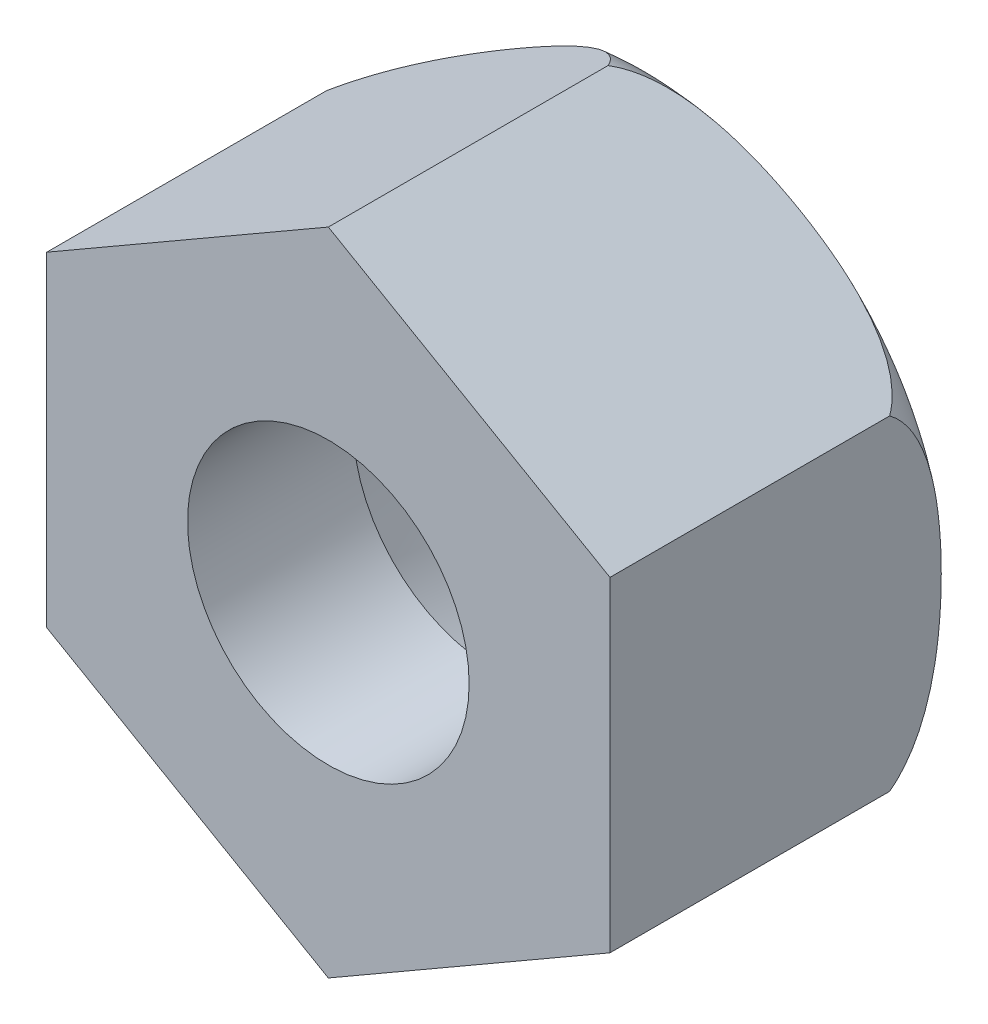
ISO-10303-21;
HEADER;
FILE_DESCRIPTION(('STEP AP214'),'2;1');
FILE_NAME('part.step','',(''),(''),'','','');
FILE_SCHEMA(('AUTOMOTIVE_DESIGN { 1 0 10303 214 1 1 1 1 }'));
ENDSEC;
DATA;
#1=APPLICATION_CONTEXT('core data for automotive mechanical design processes');
#2=APPLICATION_PROTOCOL_DEFINITION('international standard','automotive_design',2000,#1);
#3=PRODUCT_CONTEXT('',#1,'mechanical');
#4=PRODUCT('Part','Part','',(#3));
#5=PRODUCT_RELATED_PRODUCT_CATEGORY('part','',(#4));
#6=PRODUCT_DEFINITION_FORMATION('','',#4);
#7=PRODUCT_DEFINITION_CONTEXT('part definition',#1,'design');
#8=PRODUCT_DEFINITION('design','',#6,#7);
#9=PRODUCT_DEFINITION_SHAPE('','',#8);
#10=(LENGTH_UNIT() NAMED_UNIT(*) SI_UNIT(.MILLI.,.METRE.));
#11=(NAMED_UNIT(*) PLANE_ANGLE_UNIT() SI_UNIT($,.RADIAN.));
#12=(NAMED_UNIT(*) SI_UNIT($,.STERADIAN.) SOLID_ANGLE_UNIT());
#13=UNCERTAINTY_MEASURE_WITH_UNIT(LENGTH_MEASURE(1.E-05),#10,'distance_accuracy_value','');
#14=(GEOMETRIC_REPRESENTATION_CONTEXT(3) GLOBAL_UNCERTAINTY_ASSIGNED_CONTEXT((#13)) GLOBAL_UNIT_ASSIGNED_CONTEXT((#10,
#11,#12)) REPRESENTATION_CONTEXT('',''));
#15=CARTESIAN_POINT('',(0.,0.,0.));
#16=DIRECTION('',(0.,0.,1.));
#17=DIRECTION('',(1.,0.,0.));
#18=AXIS2_PLACEMENT_3D('',#15,#16,#17);
#19=CARTESIAN_POINT('',(0.,9.81495457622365,0.));
#20=DIRECTION('',(0.,0.,1.));
#21=DIRECTION('',(1.,0.,0.));
#22=AXIS2_PLACEMENT_3D('',#19,#20,#21);
#23=PLANE('',#22);
#24=CARTESIAN_POINT('',(0.,0.,0.));
#25=DIRECTION('',(0.,0.,1.));
#26=DIRECTION('',(1.,0.,0.));
#27=AXIS2_PLACEMENT_3D('',#24,#25,#26);
#28=CIRCLE('',#27,5.9);
#29=CARTESIAN_POINT('',(5.90000000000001,0.,0.));
#30=VERTEX_POINT('',#29);
#31=EDGE_CURVE('E235',#30,#30,#28,.T.);
#32=ORIENTED_EDGE('',*,*,#31,.T.);
#33=EDGE_LOOP('',(#32));
#34=FACE_BOUND('',#33,.T.);
#35=CARTESIAN_POINT('',(0.,0.,0.));
#36=DIRECTION('',(0.,0.,1.));
#37=DIRECTION('',(1.,0.,0.));
#38=AXIS2_PLACEMENT_3D('',#35,#36,#37);
#39=CIRCLE('',#38,8.50000000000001);
#40=CARTESIAN_POINT('',(8.49999999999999,0.,0.));
#41=VERTEX_POINT('',#40);
#42=CARTESIAN_POINT('',(4.25,7.36121593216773,0.));
#43=VERTEX_POINT('',#42);
#44=EDGE_CURVE('E56',#41,#43,#39,.T.);
#45=ORIENTED_EDGE('',*,*,#44,.F.);
#46=CARTESIAN_POINT('',(4.25,-7.36121593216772,0.));
#47=VERTEX_POINT('',#46);
#48=EDGE_CURVE('E112',#47,#41,#39,.T.);
#49=ORIENTED_EDGE('',*,*,#48,.F.);
#50=CARTESIAN_POINT('',(-4.25000000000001,-7.36121593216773,0.));
#51=VERTEX_POINT('',#50);
#52=EDGE_CURVE('E119',#51,#47,#39,.T.);
#53=ORIENTED_EDGE('',*,*,#52,.F.);
#54=CARTESIAN_POINT('',(-8.50000000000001,0.,0.));
#55=VERTEX_POINT('',#54);
#56=EDGE_CURVE('E292',#55,#51,#39,.T.);
#57=ORIENTED_EDGE('',*,*,#56,.F.);
#58=CARTESIAN_POINT('',(-4.25,7.36121593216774,0.));
#59=VERTEX_POINT('',#58);
#60=EDGE_CURVE('E138',#59,#55,#39,.T.);
#61=ORIENTED_EDGE('',*,*,#60,.F.);
#62=EDGE_CURVE('E136',#43,#59,#39,.T.);
#63=ORIENTED_EDGE('',*,*,#62,.F.);
#64=EDGE_LOOP('',(#45,#49,#53,#57,#61,#63));
#65=FACE_BOUND('',#64,.T.);
#66=ADVANCED_FACE('F36',(#34,#65),#23,.F.);
#67=CARTESIAN_POINT('',(8.49999999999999,4.90747728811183,10.));
#68=DIRECTION('',(-0.5,-0.866025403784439,0.));
#69=DIRECTION('',(0.866025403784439,-0.5,0.));
#70=AXIS2_PLACEMENT_3D('',#67,#68,#69);
#71=PLANE('',#70);
#72=CARTESIAN_POINT('',(-0.000199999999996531,9.81507004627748,1.55758712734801));
#73=CARTESIAN_POINT('',(0.0451150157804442,9.78890740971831,1.48692454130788));
#74=CARTESIAN_POINT('',(0.0940565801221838,9.76065098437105,1.41958595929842));
#75=CARTESIAN_POINT('',(0.197763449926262,9.70077579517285,1.29156124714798));
#76=CARTESIAN_POINT('',(0.252509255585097,9.66916828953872,1.23085415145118));
#77=CARTESIAN_POINT('',(0.4218034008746,9.5714262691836,1.06005183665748));
#78=CARTESIAN_POINT('',(0.543083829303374,9.50140498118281,0.958824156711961));
#79=CARTESIAN_POINT('',(0.762929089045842,9.37447726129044,0.801627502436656));
#80=CARTESIAN_POINT('',(0.859001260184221,9.31900996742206,0.740772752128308));
#81=CARTESIAN_POINT('',(1.05542378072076,9.20560537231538,0.629010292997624));
#82=CARTESIAN_POINT('',(1.15577537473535,9.14766735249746,0.578105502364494));
#83=CARTESIAN_POINT('',(1.36036017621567,9.02955026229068,0.484564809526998));
#84=CARTESIAN_POINT('',(1.46462080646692,8.96935535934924,0.442010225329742));
#85=CARTESIAN_POINT('',(1.67521990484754,8.8477659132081,0.364558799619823));
#86=CARTESIAN_POINT('',(1.78155816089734,8.78637149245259,0.329661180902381));
#87=CARTESIAN_POINT('',(2.00165570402,8.65929811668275,0.264714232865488));
#88=CARTESIAN_POINT('',(2.11549798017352,8.59357124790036,0.235044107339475));
#89=CARTESIAN_POINT('',(2.34429600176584,8.46147464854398,0.182028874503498));
#90=CARTESIAN_POINT('',(2.4592520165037,8.39510476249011,0.158685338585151));
#91=CARTESIAN_POINT('',(2.68999824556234,8.26188336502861,0.117459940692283));
#92=CARTESIAN_POINT('',(2.80578914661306,8.19503145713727,0.0995832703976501));
#93=CARTESIAN_POINT('',(3.03786108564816,8.06104466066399,0.0686375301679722));
#94=CARTESIAN_POINT('',(3.15414218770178,7.99390973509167,0.0555691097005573));
#95=CARTESIAN_POINT('',(3.38705597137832,7.85943689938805,0.0337218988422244));
#96=CARTESIAN_POINT('',(3.50368879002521,7.79209891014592,0.0249450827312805));
#97=CARTESIAN_POINT('',(3.73711532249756,7.65733003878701,0.0113338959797));
#98=CARTESIAN_POINT('',(3.8539090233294,7.58989916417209,0.0064992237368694));
#99=CARTESIAN_POINT('',(4.08749751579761,7.45503678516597,0.000571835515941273));
#100=CARTESIAN_POINT('',(4.20429226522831,7.38760530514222,-0.000523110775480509));
#101=CARTESIAN_POINT('',(4.43785808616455,7.25275601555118,0.000980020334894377));
#102=CARTESIAN_POINT('',(4.55462915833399,7.1853382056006,0.00357797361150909));
#103=CARTESIAN_POINT('',(4.84435832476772,7.018062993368,0.0147301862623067));
#104=CARTESIAN_POINT('',(5.01725659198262,6.91824013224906,0.0255526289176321));
#105=CARTESIAN_POINT('',(5.36248853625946,6.71892037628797,0.0564890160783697));
#106=CARTESIAN_POINT('',(5.53482205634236,6.61942357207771,0.0766053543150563));
#107=CARTESIAN_POINT('',(5.87770250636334,6.42146145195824,0.127795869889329));
#108=CARTESIAN_POINT('',(6.04825352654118,6.32299377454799,0.158832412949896));
#109=CARTESIAN_POINT('',(6.3870494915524,6.1273898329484,0.234391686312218));
#110=CARTESIAN_POINT('',(6.55529588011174,6.03025273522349,0.278905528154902));
#111=CARTESIAN_POINT('',(6.89522854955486,5.83399251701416,0.387164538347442));
#112=CARTESIAN_POINT('',(7.06673713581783,5.7349719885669,0.451674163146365));
#113=CARTESIAN_POINT('',(7.40220072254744,5.54129199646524,0.604191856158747));
#114=CARTESIAN_POINT('',(7.56615150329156,5.44663496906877,0.692212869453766));
#115=CARTESIAN_POINT('',(7.84351273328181,5.28650038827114,0.873768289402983));
#116=CARTESIAN_POINT('',(7.95983414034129,5.21934219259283,0.961304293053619));
#117=CARTESIAN_POINT('',(8.17899067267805,5.09281210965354,1.15619183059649));
#118=CARTESIAN_POINT('',(8.28188746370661,5.03340461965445,1.26344688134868));
#119=CARTESIAN_POINT('',(8.41892793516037,4.95428426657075,1.4375927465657));
#120=CARTESIAN_POINT('',(8.46093840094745,4.9300295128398,1.49635692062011));
#121=CARTESIAN_POINT('',(8.50019999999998,4.907361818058,1.55758712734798));
#122=B_SPLINE_CURVE_WITH_KNOTS('',3,(#72,#73,#74,#75,#76,#77,#78,#79,#80,#81,#82,#83,#84,#85,
#86,#87,#88,#89,#90,#91,#92,#93,#94,#95,#96,#97,#98,#99,#100,#101,#102,#103,#104,#105,#106,#107,
#108,#109,#110,#111,#112,#113,#114,#115,#116,#117,#118,#119,#120,#121),.UNSPECIFIED.,.F.,.F.,(4,
2,2,2,2,2,2,2,2,2,2,2,2,2,2,2,2,2,2,2,2,2,2,2,4),(0.,0.263341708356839,0.525825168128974,
1.04158623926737,1.42072803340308,1.79998085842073,2.18276133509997,2.56550294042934,
2.96960199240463,3.37380132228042,3.77838332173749,4.18301994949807,4.58784254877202,
4.99263417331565,5.39718434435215,5.80172091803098,6.40133913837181,7.00111188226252,
7.59883755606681,8.19616987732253,8.81995881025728,9.44409190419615,9.92367333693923,
10.400967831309,10.6293047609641),.UNSPECIFIED.);
#123=CARTESIAN_POINT('',(9.3240418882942E-12,9.81495457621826,1.55727523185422));
#124=VERTEX_POINT('',#123);
#125=EDGE_CURVE('E274',#124,#43,#122,.T.);
#126=ORIENTED_EDGE('',*,*,#125,.F.);
#127=DIRECTION('',(0.,0.,-1.));
#128=VECTOR('',#127,1.);
#129=CARTESIAN_POINT('',(0.,9.81495457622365,10.));
#130=LINE('',#129,#128);
#131=CARTESIAN_POINT('',(0.,9.81495457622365,10.));
#132=VERTEX_POINT('',#131);
#133=EDGE_CURVE('E128',#132,#124,#130,.T.);
#134=ORIENTED_EDGE('',*,*,#133,.F.);
#135=DIRECTION('',(-0.866025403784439,0.5,0.));
#136=VECTOR('',#135,1.);
#137=CARTESIAN_POINT('',(8.49999999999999,4.90747728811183,10.));
#138=LINE('',#137,#136);
#139=CARTESIAN_POINT('',(8.49999999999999,4.90747728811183,10.));
#140=VERTEX_POINT('',#139);
#141=EDGE_CURVE('E243',#140,#132,#138,.T.);
#142=ORIENTED_EDGE('',*,*,#141,.F.);
#143=DIRECTION('',(0.,0.,-1.));
#144=VECTOR('',#143,1.);
#145=CARTESIAN_POINT('',(8.49999999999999,4.90747728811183,10.));
#146=LINE('',#145,#144);
#147=CARTESIAN_POINT('',(8.49999999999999,4.90747728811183,1.55727523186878));
#148=VERTEX_POINT('',#147);
#149=EDGE_CURVE('E256',#140,#148,#146,.T.);
#150=ORIENTED_EDGE('',*,*,#149,.T.);
#151=EDGE_CURVE('E124',#43,#148,#122,.T.);
#152=ORIENTED_EDGE('',*,*,#151,.F.);
#153=EDGE_LOOP('',(#126,#134,#142,#150,#152));
#154=FACE_BOUND('',#153,.T.);
#155=ADVANCED_FACE('F38',(#154),#71,.F.);
#156=CARTESIAN_POINT('',(0.,9.81495457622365,10.));
#157=DIRECTION('',(0.5,-0.866025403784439,0.));
#158=DIRECTION('',(0.866025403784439,0.5,0.));
#159=AXIS2_PLACEMENT_3D('',#156,#157,#158);
#160=PLANE('',#159);
#161=CARTESIAN_POINT('',(-8.50019999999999,4.90736181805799,1.55758712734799));
#162=CARTESIAN_POINT('',(-8.45488498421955,4.93352445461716,1.48692454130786));
#163=CARTESIAN_POINT('',(-8.40594341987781,4.96178087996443,1.4195859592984));
#164=CARTESIAN_POINT('',(-8.30223655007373,5.02165606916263,1.29156124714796));
#165=CARTESIAN_POINT('',(-8.24749074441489,5.05326357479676,1.23085415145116));
#166=CARTESIAN_POINT('',(-8.07819659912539,5.15100559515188,1.06005183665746));
#167=CARTESIAN_POINT('',(-7.95691617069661,5.22102688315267,0.95882415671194));
#168=CARTESIAN_POINT('',(-7.73707091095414,5.34795460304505,0.801627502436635));
#169=CARTESIAN_POINT('',(-7.64099873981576,5.40342189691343,0.740772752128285));
#170=CARTESIAN_POINT('',(-7.44457621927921,5.5168264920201,0.629010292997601));
#171=CARTESIAN_POINT('',(-7.34422462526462,5.57476451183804,0.578105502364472));
#172=CARTESIAN_POINT('',(-7.13963982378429,5.69288160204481,0.484564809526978));
#173=CARTESIAN_POINT('',(-7.03537919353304,5.75307650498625,0.442010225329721));
#174=CARTESIAN_POINT('',(-6.82478009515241,5.8746659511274,0.364558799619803));
#175=CARTESIAN_POINT('',(-6.71844183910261,5.93606037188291,0.329661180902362));
#176=CARTESIAN_POINT('',(-6.49834429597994,6.06313374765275,0.26471423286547));
#177=CARTESIAN_POINT('',(-6.38450201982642,6.12886061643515,0.235044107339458));
#178=CARTESIAN_POINT('',(-6.1557039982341,6.26095721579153,0.182028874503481));
#179=CARTESIAN_POINT('',(-6.04074798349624,6.3273271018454,0.158685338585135));
#180=CARTESIAN_POINT('',(-5.81000175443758,6.46054849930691,0.117459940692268));
#181=CARTESIAN_POINT('',(-5.69421085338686,6.52740040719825,0.0995832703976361));
#182=CARTESIAN_POINT('',(-5.46213891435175,6.66138720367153,0.0686375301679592));
#183=CARTESIAN_POINT('',(-5.34585781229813,6.72852212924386,0.0555691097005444));
#184=CARTESIAN_POINT('',(-5.11294402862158,6.86299496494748,0.0337218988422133));
#185=CARTESIAN_POINT('',(-4.99631120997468,6.93033295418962,0.0249450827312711));
#186=CARTESIAN_POINT('',(-4.76288467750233,7.06510182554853,0.0113338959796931));
#187=CARTESIAN_POINT('',(-4.64609097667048,7.13253270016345,0.0064992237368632));
#188=CARTESIAN_POINT('',(-4.41250248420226,7.26739507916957,0.000571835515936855));
#189=CARTESIAN_POINT('',(-4.29570773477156,7.33482655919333,-0.000523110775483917));
#190=CARTESIAN_POINT('',(-4.06214191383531,7.46967584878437,0.000980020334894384));
#191=CARTESIAN_POINT('',(-3.94537084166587,7.53709365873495,0.00357797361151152));
#192=CARTESIAN_POINT('',(-3.65564167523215,7.70436887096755,0.0147301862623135));
#193=CARTESIAN_POINT('',(-3.48274340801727,7.80419173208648,0.0255526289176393));
#194=CARTESIAN_POINT('',(-3.13751146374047,8.00351148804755,0.0564890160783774));
#195=CARTESIAN_POINT('',(-2.96517794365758,8.1030082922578,0.0766053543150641));
#196=CARTESIAN_POINT('',(-2.62229749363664,8.30097041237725,0.127795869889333));
#197=CARTESIAN_POINT('',(-2.45174647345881,8.39943808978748,0.158832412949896));
#198=CARTESIAN_POINT('',(-2.11295050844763,8.59504203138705,0.234391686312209));
#199=CARTESIAN_POINT('',(-1.94470411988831,8.69217912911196,0.27890552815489));
#200=CARTESIAN_POINT('',(-1.60477145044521,8.88843934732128,0.387164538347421));
#201=CARTESIAN_POINT('',(-1.43326286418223,8.98745987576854,0.45167416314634));
#202=CARTESIAN_POINT('',(-1.09779927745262,9.1811398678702,0.604191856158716));
#203=CARTESIAN_POINT('',(-0.933848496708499,9.27579689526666,0.692212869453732));
#204=CARTESIAN_POINT('',(-0.656487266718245,9.4359314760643,0.873768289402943));
#205=CARTESIAN_POINT('',(-0.540165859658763,9.50308967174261,0.961304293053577));
#206=CARTESIAN_POINT('',(-0.321009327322,9.62961975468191,1.15619183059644));
#207=CARTESIAN_POINT('',(-0.218112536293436,9.68902724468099,1.26344688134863));
#208=CARTESIAN_POINT('',(-0.0810720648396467,9.76814759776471,1.43759274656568));
#209=CARTESIAN_POINT('',(-0.0390615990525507,9.79240235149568,1.49635692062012));
#210=CARTESIAN_POINT('',(0.000200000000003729,9.81507004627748,1.55758712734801));
#211=B_SPLINE_CURVE_WITH_KNOTS('',3,(#161,#162,#163,#164,#165,#166,#167,#168,#169,#170,#171,
#172,#173,#174,#175,#176,#177,#178,#179,#180,#181,#182,#183,#184,#185,#186,#187,#188,#189,#190,
#191,#192,#193,#194,#195,#196,#197,#198,#199,#200,#201,#202,#203,#204,#205,#206,#207,#208,#209,
#210),.UNSPECIFIED.,.F.,.F.,(4,2,2,2,2,2,2,2,2,2,2,2,2,2,2,2,2,2,2,2,2,2,2,2,4),(0.,
0.263341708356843,0.525825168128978,1.04158623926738,1.4207280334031,1.79998085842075,
2.1827613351,2.56550294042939,2.96960199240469,3.37380132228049,3.77838332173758,
4.18301994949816,4.58784254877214,4.99263417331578,5.39718434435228,5.80172091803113,
6.40133913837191,7.00111188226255,7.59883755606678,8.19616987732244,8.81995881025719,
9.44409190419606,9.92367333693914,10.4009678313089,10.6293047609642),.UNSPECIFIED.);
#212=CARTESIAN_POINT('',(-8.50000000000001,4.90747728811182,1.55727523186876));
#213=VERTEX_POINT('',#212);
#214=EDGE_CURVE('E175',#213,#59,#211,.T.);
#215=ORIENTED_EDGE('',*,*,#214,.F.);
#216=DIRECTION('',(0.,0.,-1.));
#217=VECTOR('',#216,1.);
#218=CARTESIAN_POINT('',(-8.50000000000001,4.90747728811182,10.));
#219=LINE('',#218,#217);
#220=CARTESIAN_POINT('',(-8.50000000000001,4.90747728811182,10.));
#221=VERTEX_POINT('',#220);
#222=EDGE_CURVE('E264',#221,#213,#219,.T.);
#223=ORIENTED_EDGE('',*,*,#222,.F.);
#224=DIRECTION('',(-0.866025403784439,-0.5,0.));
#225=VECTOR('',#224,1.);
#226=CARTESIAN_POINT('',(0.,9.81495457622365,10.));
#227=LINE('',#226,#225);
#228=EDGE_CURVE('E246',#132,#221,#227,.T.);
#229=ORIENTED_EDGE('',*,*,#228,.F.);
#230=ORIENTED_EDGE('',*,*,#133,.T.);
#231=EDGE_CURVE('E171',#59,#124,#211,.T.);
#232=ORIENTED_EDGE('',*,*,#231,.F.);
#233=EDGE_LOOP('',(#215,#223,#229,#230,#232));
#234=FACE_BOUND('',#233,.T.);
#235=ADVANCED_FACE('F181',(#234),#160,.F.);
#236=CARTESIAN_POINT('',(-8.50000000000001,4.90747728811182,10.));
#237=DIRECTION('',(1.,0.,0.));
#238=DIRECTION('',(0.,1.,0.));
#239=AXIS2_PLACEMENT_3D('',#236,#237,#238);
#240=PLANE('',#239);
#241=CARTESIAN_POINT('',(-8.50000000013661,0.,-7.89255239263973E-11));
#242=CARTESIAN_POINT('',(-8.50000000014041,0.253208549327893,-2.06588581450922E-06));
#243=CARTESIAN_POINT('',(-8.5000000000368,0.506417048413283,0.00644525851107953));
#244=CARTESIAN_POINT('',(-8.49999999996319,1.01232295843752,0.0331797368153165));
#245=CARTESIAN_POINT('',(-8.49999999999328,1.26501995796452,0.0534754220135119));
#246=CARTESIAN_POINT('',(-8.50000000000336,1.64216318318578,0.0964693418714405));
#247=CARTESIAN_POINT('',(-8.5000000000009,1.76733800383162,0.112851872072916));
#248=CARTESIAN_POINT('',(-8.49999999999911,2.01696843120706,0.150361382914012));
#249=CARTESIAN_POINT('',(-8.49999999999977,2.14142413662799,0.171487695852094));
#250=CARTESIAN_POINT('',(-8.50000000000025,2.38914915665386,0.219130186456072));
#251=CARTESIAN_POINT('',(-8.50000000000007,2.51241975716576,0.245639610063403));
#252=CARTESIAN_POINT('',(-8.49999999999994,2.75748485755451,0.304887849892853));
#253=CARTESIAN_POINT('',(-8.49999999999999,2.87927923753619,0.337627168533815));
#254=CARTESIAN_POINT('',(-8.50000000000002,3.11102646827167,0.407380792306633));
#255=CARTESIAN_POINT('',(-8.50000000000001,3.2211448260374,0.443840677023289));
#256=CARTESIAN_POINT('',(-8.5,3.43881150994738,0.52369435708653));
#257=CARTESIAN_POINT('',(-8.5,3.54636090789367,0.567085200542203));
#258=CARTESIAN_POINT('',(-8.50000000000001,3.75770908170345,0.66166669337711));
#259=CARTESIAN_POINT('',(-8.50000000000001,3.86151610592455,0.712838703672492));
#260=CARTESIAN_POINT('',(-8.50000000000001,4.06421706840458,0.824049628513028));
#261=CARTESIAN_POINT('',(-8.50000000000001,4.16311450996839,0.884082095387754));
#262=CARTESIAN_POINT('',(-8.50000000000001,4.36676792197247,1.02261218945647));
#263=CARTESIAN_POINT('',(-8.50000000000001,4.47059592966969,1.10249829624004));
#264=CARTESIAN_POINT('',(-8.50000000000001,4.6659395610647,1.27624818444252));
#265=CARTESIAN_POINT('',(-8.50000000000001,4.75746578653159,1.37009978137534));
#266=CARTESIAN_POINT('',(-8.50000000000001,4.90849613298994,1.5543085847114));
#267=CARTESIAN_POINT('',(-8.50000000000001,4.97080078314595,1.64234739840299));
#268=CARTESIAN_POINT('',(-8.50000000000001,5.08020661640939,1.82749833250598));
#269=CARTESIAN_POINT('',(-8.50000000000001,5.12731716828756,1.92460481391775));
#270=CARTESIAN_POINT('',(-8.50000000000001,5.20322095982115,2.1269365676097));
#271=CARTESIAN_POINT('',(-8.50000000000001,5.23183272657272,2.23223124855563));
#272=CARTESIAN_POINT('',(-8.50000000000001,5.26722675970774,2.44642403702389));
#273=CARTESIAN_POINT('',(-8.50000000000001,5.2740298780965,2.55531860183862));
#274=CARTESIAN_POINT('',(-8.50000000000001,5.26586686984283,2.75529768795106));
#275=CARTESIAN_POINT('',(-8.50000000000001,5.254107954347,2.84652947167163));
#276=CARTESIAN_POINT('',(-8.50000000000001,5.2154682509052,3.02570493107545));
#277=CARTESIAN_POINT('',(-8.50000000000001,5.18858648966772,3.11364839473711));
#278=CARTESIAN_POINT('',(-8.50000000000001,5.1213128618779,3.28459601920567));
#279=CARTESIAN_POINT('',(-8.50000000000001,5.08085984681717,3.36757578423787));
#280=CARTESIAN_POINT('',(-8.50000000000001,4.9886811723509,3.52695749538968));
#281=CARTESIAN_POINT('',(-8.50000000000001,4.93695090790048,3.60335673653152));
#282=CARTESIAN_POINT('',(-8.50000000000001,4.79247302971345,3.79034694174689));
#283=CARTESIAN_POINT('',(-8.50000000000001,4.69308407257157,3.89580838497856));
#284=CARTESIAN_POINT('',(-8.50000000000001,4.47887515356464,4.08974173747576));
#285=CARTESIAN_POINT('',(-8.50000000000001,4.36401442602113,4.17816721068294));
#286=CARTESIAN_POINT('',(-8.50000000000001,4.14758854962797,4.32371833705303));
#287=CARTESIAN_POINT('',(-8.50000000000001,4.04782537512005,4.38358228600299));
#288=CARTESIAN_POINT('',(-8.50000000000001,3.84342750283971,4.49441227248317));
#289=CARTESIAN_POINT('',(-8.50000000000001,3.7387896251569,4.54537239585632));
#290=CARTESIAN_POINT('',(-8.50000000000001,3.52596943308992,4.63943489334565));
#291=CARTESIAN_POINT('',(-8.50000000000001,3.41778410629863,4.68253037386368));
#292=CARTESIAN_POINT('',(-8.50000000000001,3.19888425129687,4.76178867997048));
#293=CARTESIAN_POINT('',(-8.50000000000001,3.08816871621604,4.7979486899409));
#294=CARTESIAN_POINT('',(-8.50000000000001,2.74757517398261,4.89905955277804));
#295=CARTESIAN_POINT('',(-8.50000000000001,2.51480886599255,4.95430434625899));
#296=CARTESIAN_POINT('',(-8.50000000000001,2.04546182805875,5.04541671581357));
#297=CARTESIAN_POINT('',(-8.50000000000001,1.80887685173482,5.08126093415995));
#298=CARTESIAN_POINT('',(-8.50000000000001,1.33250891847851,5.13791341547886));
#299=CARTESIAN_POINT('',(-8.50000000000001,1.0927152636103,5.15862893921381));
#300=CARTESIAN_POINT('',(-8.50000000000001,0.612532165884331,5.1873232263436));
#301=CARTESIAN_POINT('',(-8.50000000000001,0.372143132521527,5.19530912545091));
#302=CARTESIAN_POINT('',(-8.50000000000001,-0.0124274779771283,5.19873339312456));
#303=CARTESIAN_POINT('',(-8.50000000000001,-0.156587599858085,5.19791572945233));
#304=CARTESIAN_POINT('',(-8.50000000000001,-0.444829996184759,5.19201556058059));
#305=CARTESIAN_POINT('',(-8.50000000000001,-0.588912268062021,5.18693292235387));
#306=CARTESIAN_POINT('',(-8.50000000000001,-0.877019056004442,5.17225969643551));
#307=CARTESIAN_POINT('',(-8.50000000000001,-1.02104330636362,5.16266383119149));
#308=CARTESIAN_POINT('',(-8.50000000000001,-1.3086764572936,5.13851497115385));
#309=CARTESIAN_POINT('',(-8.50000000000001,-1.45228537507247,5.12396218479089));
#310=CARTESIAN_POINT('',(-8.50000000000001,-1.7377672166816,5.08937276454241));
#311=CARTESIAN_POINT('',(-8.50000000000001,-1.87964510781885,5.06937772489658));
#312=CARTESIAN_POINT('',(-8.50000000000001,-2.16239394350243,5.02299864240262));
#313=CARTESIAN_POINT('',(-8.50000000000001,-2.30326471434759,4.99661352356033));
#314=CARTESIAN_POINT('',(-8.50000000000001,-2.5831203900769,4.93644140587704));
#315=CARTESIAN_POINT('',(-8.50000000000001,-2.72210869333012,4.90267041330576));
#316=CARTESIAN_POINT('',(-8.50000000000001,-2.99763839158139,4.82639986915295));
#317=CARTESIAN_POINT('',(-8.50000000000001,-3.1341810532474,4.78390498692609));
#318=CARTESIAN_POINT('',(-8.50000000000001,-3.36635447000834,4.70181061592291));
#319=CARTESIAN_POINT('',(-8.50000000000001,-3.46285066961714,4.66466396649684));
#320=CARTESIAN_POINT('',(-8.50000000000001,-3.65333182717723,4.58430303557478));
#321=CARTESIAN_POINT('',(-8.50000000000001,-3.74731622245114,4.54108740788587));
#322=CARTESIAN_POINT('',(-8.50000000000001,-3.93170543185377,4.44796485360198));
#323=CARTESIAN_POINT('',(-8.50000000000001,-4.02211706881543,4.39807156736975));
#324=CARTESIAN_POINT('',(-8.50000000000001,-4.1983550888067,4.29081743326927));
#325=CARTESIAN_POINT('',(-8.50000000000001,-4.28418410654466,4.23346094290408));
#326=CARTESIAN_POINT('',(-8.50000000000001,-4.46969547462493,4.0957850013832));
#327=CARTESIAN_POINT('',(-8.50000000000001,-4.56777027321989,4.01325627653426));
#328=CARTESIAN_POINT('',(-8.50000000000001,-4.75072172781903,3.83457578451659));
#329=CARTESIAN_POINT('',(-8.50000000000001,-4.8356118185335,3.73843807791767));
#330=CARTESIAN_POINT('',(-8.50000000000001,-4.97265146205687,3.55221482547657));
#331=CARTESIAN_POINT('',(-8.50000000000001,-5.02795748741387,3.46447188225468));
#332=CARTESIAN_POINT('',(-8.50000000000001,-5.12344383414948,3.28105043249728));
#333=CARTESIAN_POINT('',(-8.50000000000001,-5.16363477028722,3.18537755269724));
#334=CARTESIAN_POINT('',(-8.50000000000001,-5.22618175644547,2.98741406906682));
#335=CARTESIAN_POINT('',(-8.50000000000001,-5.24839083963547,2.88507617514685));
#336=CARTESIAN_POINT('',(-8.50000000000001,-5.2723583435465,2.67803197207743));
#337=CARTESIAN_POINT('',(-8.50000000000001,-5.27412913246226,2.57332713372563));
#338=CARTESIAN_POINT('',(-8.50000000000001,-5.2582185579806,2.37919856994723));
#339=CARTESIAN_POINT('',(-8.50000000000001,-5.24303581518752,2.28955766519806));
#340=CARTESIAN_POINT('',(-8.50000000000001,-5.19822353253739,2.11399575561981));
#341=CARTESIAN_POINT('',(-8.50000000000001,-5.16859249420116,2.02807513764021));
#342=CARTESIAN_POINT('',(-8.50000000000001,-5.09568441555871,1.85937301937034));
#343=CARTESIAN_POINT('',(-8.50000000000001,-5.05204123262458,1.77675164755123));
#344=CARTESIAN_POINT('',(-8.50000000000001,-4.95371630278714,1.61842233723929));
#345=CARTESIAN_POINT('',(-8.50000000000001,-4.89902942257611,1.54271763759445));
#346=CARTESIAN_POINT('',(-8.50000000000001,-4.74510145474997,1.35509113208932));
#347=CARTESIAN_POINT('',(-8.50000000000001,-4.63888958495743,1.24888501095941));
#348=CARTESIAN_POINT('',(-8.50000000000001,-4.4110772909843,1.05445950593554));
#349=CARTESIAN_POINT('',(-8.50000000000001,-4.28943563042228,0.966290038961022));
#350=CARTESIAN_POINT('',(-8.50000000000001,-4.05919769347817,0.82068452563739));
#351=CARTESIAN_POINT('',(-8.5,-3.95225536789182,0.760575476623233));
#352=CARTESIAN_POINT('',(-8.50000000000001,-3.73351193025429,0.649859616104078));
#353=CARTESIAN_POINT('',(-8.50000000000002,-3.62170749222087,0.599259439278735));
#354=CARTESIAN_POINT('',(-8.49999999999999,-3.3945804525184,0.506352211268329));
#355=CARTESIAN_POINT('',(-8.49999999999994,-3.27925358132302,0.464055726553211));
#356=CARTESIAN_POINT('',(-8.50000000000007,-3.0461684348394,0.386736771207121));
#357=CARTESIAN_POINT('',(-8.50000000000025,-2.92840922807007,0.351717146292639));
#358=CARTESIAN_POINT('',(-8.49999999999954,-2.5821373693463,0.25867765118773));
#359=CARTESIAN_POINT('',(-8.49999999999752,-2.35134922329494,0.209117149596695));
#360=CARTESIAN_POINT('',(-8.5000000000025,-1.88661854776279,0.127789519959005));
#361=CARTESIAN_POINT('',(-8.5000000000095,-1.65267317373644,0.0960397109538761));
#362=CARTESIAN_POINT('',(-8.49999999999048,-1.18250684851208,0.0465834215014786));
#363=CARTESIAN_POINT('',(-8.49999999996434,-0.946280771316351,0.028927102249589));
#364=CARTESIAN_POINT('',(-8.50000000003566,-0.473369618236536,0.00563897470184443));
#365=CARTESIAN_POINT('',(-8.50000000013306,-0.236684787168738,1.93091852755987E-06));
#366=CARTESIAN_POINT('',(-8.50000000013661,0.,-7.89255239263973E-11));
#367=B_SPLINE_CURVE_WITH_KNOTS('',3,(#241,#242,#243,#244,#245,#246,#247,#248,#249,#250,#251,
#252,#253,#254,#255,#256,#257,#258,#259,#260,#261,#262,#263,#264,#265,#266,#267,#268,#269,#270,
#271,#272,#273,#274,#275,#276,#277,#278,#279,#280,#281,#282,#283,#284,#285,#286,#287,#288,#289,
#290,#291,#292,#293,#294,#295,#296,#297,#298,#299,#300,#301,#302,#303,#304,#305,#306,#307,#308,
#309,#310,#311,#312,#313,#314,#315,#316,#317,#318,#319,#320,#321,#322,#323,#324,#325,#326,#327,
#328,#329,#330,#331,#332,#333,#334,#335,#336,#337,#338,#339,#340,#341,#342,#343,#344,#345,#346,
#347,#348,#349,#350,#351,#352,#353,#354,#355,#356,#357,#358,#359,#360,#361,#362,#363,#364,#365,
#366),.UNSPECIFIED.,.T.,.F.,(4,2,2,2,2,2,2,2,2,2,2,2,2,2,2,2,2,2,2,2,2,2,2,2,2,2,2,2,2,2,2,2,2,
2,2,2,2,2,2,2,2,2,2,2,2,2,2,2,2,2,2,2,2,2,2,2,2,2,2,2,2,2,4),(0.,0.759550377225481,
1.5195690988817,1.89822424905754,2.27682613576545,2.65495590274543,3.03311617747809,
3.38090887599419,3.72855384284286,4.07537880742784,4.42195262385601,4.81389736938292,
5.20550213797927,5.52783735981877,5.84997344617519,6.17522357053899,6.50016261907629,
6.77479522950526,7.04944551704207,7.32535030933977,7.60136797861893,8.0336490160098,
8.46709217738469,8.81564310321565,9.1644246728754,9.51351050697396,9.86273776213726,
10.5791718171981,11.2964665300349,12.0181221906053,12.7393731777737,13.1718074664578,
13.6042552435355,14.0372099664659,14.4701464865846,14.8998628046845,15.329651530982,
15.758517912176,16.187155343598,16.497179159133,16.8072718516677,17.1167405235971,
17.4260293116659,17.8094182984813,18.1924140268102,18.5023654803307,18.8120988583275,
19.124338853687,19.436389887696,19.7078781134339,19.9793945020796,20.2586786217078,
20.5380928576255,20.986134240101,21.4353992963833,21.8029131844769,22.1706825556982,
22.5389169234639,22.9072950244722,23.6143940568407,24.3221794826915,25.0324729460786,
25.7424569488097),.UNSPECIFIED.);
#368=EDGE_CURVE('E240',#55,#213,#367,.T.);
#369=ORIENTED_EDGE('',*,*,#368,.F.);
#370=CARTESIAN_POINT('',(-8.50000000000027,-4.90747728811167,1.55727523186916));
#371=VERTEX_POINT('',#370);
#372=EDGE_CURVE('E176',#371,#55,#367,.T.);
#373=ORIENTED_EDGE('',*,*,#372,.F.);
#374=DIRECTION('',(0.,0.,-1.));
#375=VECTOR('',#374,1.);
#376=CARTESIAN_POINT('',(-8.50000000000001,-4.90747728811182,10.));
#377=LINE('',#376,#375);
#378=CARTESIAN_POINT('',(-8.50000000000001,-4.90747728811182,10.));
#379=VERTEX_POINT('',#378);
#380=EDGE_CURVE('E261',#379,#371,#377,.T.);
#381=ORIENTED_EDGE('',*,*,#380,.F.);
#382=DIRECTION('',(0.,-1.,0.));
#383=VECTOR('',#382,1.);
#384=CARTESIAN_POINT('',(-8.50000000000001,4.90747728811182,10.));
#385=LINE('',#384,#383);
#386=EDGE_CURVE('E248',#221,#379,#385,.T.);
#387=ORIENTED_EDGE('',*,*,#386,.F.);
#388=ORIENTED_EDGE('',*,*,#222,.T.);
#389=EDGE_LOOP('',(#369,#373,#381,#387,#388));
#390=FACE_BOUND('',#389,.T.);
#391=ADVANCED_FACE('F184',(#390),#240,.F.);
#392=CARTESIAN_POINT('',(-8.50000000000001,-4.90747728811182,10.));
#393=DIRECTION('',(0.5,0.866025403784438,0.));
#394=DIRECTION('',(-0.866025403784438,0.5,0.));
#395=AXIS2_PLACEMENT_3D('',#392,#393,#394);
#396=PLANE('',#395);
#397=CARTESIAN_POINT('',(0.000199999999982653,-9.81507004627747,1.55758712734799));
#398=CARTESIAN_POINT('',(-0.0451150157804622,-9.7889074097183,1.48692454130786));
#399=CARTESIAN_POINT('',(-0.0940565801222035,-9.76065098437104,1.4195859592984));
#400=CARTESIAN_POINT('',(-0.197763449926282,-9.70077579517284,1.29156124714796));
#401=CARTESIAN_POINT('',(-0.252509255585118,-9.66916828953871,1.23085415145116));
#402=CARTESIAN_POINT('',(-0.421803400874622,-9.57142626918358,1.06005183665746));
#403=CARTESIAN_POINT('',(-0.543083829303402,-9.50140498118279,0.958824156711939));
#404=CARTESIAN_POINT('',(-0.762929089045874,-9.37447726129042,0.801627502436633));
#405=CARTESIAN_POINT('',(-0.859001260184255,-9.31900996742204,0.740772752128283));
#406=CARTESIAN_POINT('',(-1.0554237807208,-9.20560537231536,0.6290102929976));
#407=CARTESIAN_POINT('',(-1.15577537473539,-9.14766735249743,0.578105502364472));
#408=CARTESIAN_POINT('',(-1.36036017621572,-9.02955026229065,0.484564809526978));
#409=CARTESIAN_POINT('',(-1.46462080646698,-8.96935535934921,0.442010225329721));
#410=CARTESIAN_POINT('',(-1.6752199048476,-8.84776591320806,0.364558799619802));
#411=CARTESIAN_POINT('',(-1.7815581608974,-8.78637149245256,0.329661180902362));
#412=CARTESIAN_POINT('',(-2.00165570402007,-8.65929811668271,0.26471423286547));
#413=CARTESIAN_POINT('',(-2.11549798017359,-8.59357124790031,0.235044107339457));
#414=CARTESIAN_POINT('',(-2.34429600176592,-8.46147464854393,0.18202887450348));
#415=CARTESIAN_POINT('',(-2.45925201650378,-8.39510476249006,0.158685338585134));
#416=CARTESIAN_POINT('',(-2.68999824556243,-8.26188336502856,0.117459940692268));
#417=CARTESIAN_POINT('',(-2.80578914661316,-8.19503145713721,0.0995832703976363));
#418=CARTESIAN_POINT('',(-3.03786108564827,-8.06104466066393,0.0686375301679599));
#419=CARTESIAN_POINT('',(-3.15414218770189,-7.99390973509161,0.0555691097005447));
#420=CARTESIAN_POINT('',(-3.38705597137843,-7.85943689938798,0.0337218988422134));
#421=CARTESIAN_POINT('',(-3.50368879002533,-7.79209891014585,0.0249450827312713));
#422=CARTESIAN_POINT('',(-3.73711532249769,-7.65733003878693,0.0113338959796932));
#423=CARTESIAN_POINT('',(-3.85390902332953,-7.58989916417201,0.0064992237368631));
#424=CARTESIAN_POINT('',(-4.08749751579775,-7.45503678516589,0.000571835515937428));
#425=CARTESIAN_POINT('',(-4.20429226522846,-7.38760530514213,-0.0005231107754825));
#426=CARTESIAN_POINT('',(-4.4378580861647,-7.2527560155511,0.00098002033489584));
#427=CARTESIAN_POINT('',(-4.55462915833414,-7.18533820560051,0.00357797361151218));
#428=CARTESIAN_POINT('',(-4.84435832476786,-7.01806299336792,0.0147301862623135));
#429=CARTESIAN_POINT('',(-5.01725659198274,-6.91824013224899,0.0255526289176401));
#430=CARTESIAN_POINT('',(-5.36248853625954,-6.71892037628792,0.0564890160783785));
#431=CARTESIAN_POINT('',(-5.53482205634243,-6.61942357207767,0.0766053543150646));
#432=CARTESIAN_POINT('',(-5.87770250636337,-6.42146145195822,0.127795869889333));
#433=CARTESIAN_POINT('',(-6.04825352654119,-6.32299377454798,0.158832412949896));
#434=CARTESIAN_POINT('',(-6.38704949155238,-6.12738983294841,0.23439168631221));
#435=CARTESIAN_POINT('',(-6.5552958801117,-6.03025273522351,0.27890552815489));
#436=CARTESIAN_POINT('',(-6.8952285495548,-5.83399251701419,0.387164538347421));
#437=CARTESIAN_POINT('',(-7.06673713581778,-5.73497198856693,0.451674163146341));
#438=CARTESIAN_POINT('',(-7.40220072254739,-5.54129199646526,0.60419185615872));
#439=CARTESIAN_POINT('',(-7.56615150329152,-5.44663496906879,0.692212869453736));
#440=CARTESIAN_POINT('',(-7.84351273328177,-5.28650038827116,0.87376828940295));
#441=CARTESIAN_POINT('',(-7.95983414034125,-5.21934219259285,0.961304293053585));
#442=CARTESIAN_POINT('',(-8.17899067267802,-5.09281210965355,1.15619183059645));
#443=CARTESIAN_POINT('',(-8.28188746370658,-5.03340461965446,1.26344688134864));
#444=CARTESIAN_POINT('',(-8.41892793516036,-4.95428426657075,1.43759274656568));
#445=CARTESIAN_POINT('',(-8.46093840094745,-4.93002951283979,1.49635692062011));
#446=CARTESIAN_POINT('',(-8.50019999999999,-4.90736181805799,1.55758712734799));
#447=B_SPLINE_CURVE_WITH_KNOTS('',3,(#397,#398,#399,#400,#401,#402,#403,#404,#405,#406,#407,
#408,#409,#410,#411,#412,#413,#414,#415,#416,#417,#418,#419,#420,#421,#422,#423,#424,#425,#426,
#427,#428,#429,#430,#431,#432,#433,#434,#435,#436,#437,#438,#439,#440,#441,#442,#443,#444,#445,
#446),.UNSPECIFIED.,.F.,.F.,(4,2,2,2,2,2,2,2,2,2,2,2,2,2,2,2,2,2,2,2,2,2,2,2,4),(0.,
0.263341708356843,0.525825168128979,1.04158623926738,1.4207280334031,1.79998085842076,
2.1827613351,2.56550294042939,2.96960199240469,3.3738013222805,3.77838332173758,
4.18301994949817,4.58784254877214,4.99263417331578,5.39718434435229,5.80172091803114,
6.40133913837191,7.00111188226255,7.59883755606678,8.19616987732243,8.81995881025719,
9.44409190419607,9.92367333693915,10.4009678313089,10.6293047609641),.UNSPECIFIED.);
#448=CARTESIAN_POINT('',(-2.79638247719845E-13,-9.81495457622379,1.55727523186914));
#449=VERTEX_POINT('',#448);
#450=EDGE_CURVE('E166',#449,#51,#447,.T.);
#451=ORIENTED_EDGE('',*,*,#450,.F.);
#452=DIRECTION('',(0.,0.,-1.));
#453=VECTOR('',#452,1.);
#454=CARTESIAN_POINT('',(0.,-9.81495457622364,10.));
#455=LINE('',#454,#453);
#456=CARTESIAN_POINT('',(0.,-9.81495457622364,10.));
#457=VERTEX_POINT('',#456);
#458=EDGE_CURVE('E259',#457,#449,#455,.T.);
#459=ORIENTED_EDGE('',*,*,#458,.F.);
#460=DIRECTION('',(0.866025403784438,-0.5,0.));
#461=VECTOR('',#460,1.);
#462=CARTESIAN_POINT('',(-8.50000000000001,-4.90747728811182,10.));
#463=LINE('',#462,#461);
#464=EDGE_CURVE('E250',#379,#457,#463,.T.);
#465=ORIENTED_EDGE('',*,*,#464,.F.);
#466=ORIENTED_EDGE('',*,*,#380,.T.);
#467=EDGE_CURVE('E278',#51,#371,#447,.T.);
#468=ORIENTED_EDGE('',*,*,#467,.F.);
#469=EDGE_LOOP('',(#451,#459,#465,#466,#468));
#470=FACE_BOUND('',#469,.T.);
#471=ADVANCED_FACE('F188',(#470),#396,.F.);
#472=CARTESIAN_POINT('',(0.,-9.81495457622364,10.));
#473=DIRECTION('',(-0.5,0.866025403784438,0.));
#474=DIRECTION('',(-0.866025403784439,-0.5,0.));
#475=AXIS2_PLACEMENT_3D('',#472,#473,#474);
#476=PLANE('',#475);
#477=CARTESIAN_POINT('',(8.50019999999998,-4.90736181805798,1.55758712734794));
#478=CARTESIAN_POINT('',(8.45488498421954,-4.93352445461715,1.48692454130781));
#479=CARTESIAN_POINT('',(8.40594341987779,-4.96178087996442,1.41958595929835));
#480=CARTESIAN_POINT('',(8.30223655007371,-5.02165606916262,1.29156124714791));
#481=CARTESIAN_POINT('',(8.24749074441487,-5.05326357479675,1.23085415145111));
#482=CARTESIAN_POINT('',(8.07819659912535,-5.15100559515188,1.06005183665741));
#483=CARTESIAN_POINT('',(7.95691617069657,-5.22102688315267,0.958824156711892));
#484=CARTESIAN_POINT('',(7.73707091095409,-5.34795460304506,0.801627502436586));
#485=CARTESIAN_POINT('',(7.6409987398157,-5.40342189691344,0.740772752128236));
#486=CARTESIAN_POINT('',(7.44457621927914,-5.51682649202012,0.629010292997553));
#487=CARTESIAN_POINT('',(7.34422462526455,-5.57476451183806,0.578105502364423));
#488=CARTESIAN_POINT('',(7.13963982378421,-5.69288160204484,0.48456480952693));
#489=CARTESIAN_POINT('',(7.03537919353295,-5.75307650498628,0.442010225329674));
#490=CARTESIAN_POINT('',(6.82478009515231,-5.87466595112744,0.364558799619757));
#491=CARTESIAN_POINT('',(6.71844183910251,-5.93606037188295,0.329661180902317));
#492=CARTESIAN_POINT('',(6.49834429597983,-6.0631337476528,0.264714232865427));
#493=CARTESIAN_POINT('',(6.3845020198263,-6.1288606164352,0.235044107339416));
#494=CARTESIAN_POINT('',(6.15570399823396,-6.26095721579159,0.182028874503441));
#495=CARTESIAN_POINT('',(6.04074798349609,-6.32732710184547,0.158685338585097));
#496=CARTESIAN_POINT('',(5.81000175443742,-6.46054849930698,0.117459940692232));
#497=CARTESIAN_POINT('',(5.69421085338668,-6.52740040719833,0.0995832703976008));
#498=CARTESIAN_POINT('',(5.46213891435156,-6.66138720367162,0.0686375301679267));
#499=CARTESIAN_POINT('',(5.34585781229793,-6.72852212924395,0.0555691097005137));
#500=CARTESIAN_POINT('',(5.11294402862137,-6.86299496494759,0.0337218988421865));
#501=CARTESIAN_POINT('',(4.99631120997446,-6.93033295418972,0.0249450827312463));
#502=CARTESIAN_POINT('',(4.76288467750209,-7.06510182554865,0.0113338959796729));
#503=CARTESIAN_POINT('',(4.64609097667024,-7.13253270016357,0.00649922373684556));
#504=CARTESIAN_POINT('',(4.412502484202,-7.26739507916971,0.00057183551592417));
#505=CARTESIAN_POINT('',(4.29570773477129,-7.33482655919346,-0.000523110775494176));
#506=CARTESIAN_POINT('',(4.06214191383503,-7.46967584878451,0.00098002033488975));
#507=CARTESIAN_POINT('',(3.94537084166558,-7.5370936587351,0.00357797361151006));
#508=CARTESIAN_POINT('',(3.65564167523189,-7.70436887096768,0.0147301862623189));
#509=CARTESIAN_POINT('',(3.48274340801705,-7.80419173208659,0.0255526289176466));
#510=CARTESIAN_POINT('',(3.13751146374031,-8.00351148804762,0.0564890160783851));
#511=CARTESIAN_POINT('',(2.96517794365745,-8.10300829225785,0.0766053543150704));
#512=CARTESIAN_POINT('',(2.62229749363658,-8.30097041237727,0.127795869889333));
#513=CARTESIAN_POINT('',(2.45174647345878,-8.39943808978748,0.158832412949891));
#514=CARTESIAN_POINT('',(2.11295050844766,-8.59504203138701,0.23439168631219));
#515=CARTESIAN_POINT('',(1.94470411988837,-8.6921791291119,0.27890552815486));
#516=CARTESIAN_POINT('',(1.6047714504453,-8.88843934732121,0.387164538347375));
#517=CARTESIAN_POINT('',(1.43326286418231,-8.98745987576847,0.451674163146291));
#518=CARTESIAN_POINT('',(1.09779927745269,-9.18113986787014,0.604191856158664));
#519=CARTESIAN_POINT('',(0.933848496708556,-9.27579689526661,0.692212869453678));
#520=CARTESIAN_POINT('',(0.656487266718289,-9.43593147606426,0.873768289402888));
#521=CARTESIAN_POINT('',(0.540165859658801,-9.50308967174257,0.961304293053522));
#522=CARTESIAN_POINT('',(0.321009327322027,-9.62961975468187,1.15619183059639));
#523=CARTESIAN_POINT('',(0.218112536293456,-9.68902724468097,1.26344688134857));
#524=CARTESIAN_POINT('',(0.0810720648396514,-9.7681475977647,1.43759274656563));
#525=CARTESIAN_POINT('',(0.0390615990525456,-9.79240235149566,1.49635692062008));
#526=CARTESIAN_POINT('',(-0.000200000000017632,-9.81507004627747,1.55758712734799));
#527=B_SPLINE_CURVE_WITH_KNOTS('',3,(#477,#478,#479,#480,#481,#482,#483,#484,#485,#486,#487,
#488,#489,#490,#491,#492,#493,#494,#495,#496,#497,#498,#499,#500,#501,#502,#503,#504,#505,#506,
#507,#508,#509,#510,#511,#512,#513,#514,#515,#516,#517,#518,#519,#520,#521,#522,#523,#524,#525,
#526),.UNSPECIFIED.,.F.,.F.,(4,2,2,2,2,2,2,2,2,2,2,2,2,2,2,2,2,2,2,2,2,2,2,2,4),(0.,
0.26334170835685,0.525825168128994,1.04158623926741,1.42072803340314,1.79998085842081,
2.18276133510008,2.56550294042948,2.96960199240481,3.37380132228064,3.77838332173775,
4.18301994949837,4.58784254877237,4.99263417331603,5.39718434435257,5.80172091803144,
6.4013391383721,7.00111188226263,7.59883755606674,8.19616987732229,8.81995881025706,
9.44409190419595,9.92367333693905,10.4009678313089,10.6293047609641),.UNSPECIFIED.);
#528=CARTESIAN_POINT('',(8.49999999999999,-4.90747728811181,1.5572752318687));
#529=VERTEX_POINT('',#528);
#530=EDGE_CURVE('E115',#529,#47,#527,.T.);
#531=ORIENTED_EDGE('',*,*,#530,.F.);
#532=DIRECTION('',(0.,0.,-1.));
#533=VECTOR('',#532,1.);
#534=CARTESIAN_POINT('',(8.49999999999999,-4.90747728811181,10.));
#535=LINE('',#534,#533);
#536=CARTESIAN_POINT('',(8.49999999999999,-4.90747728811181,10.));
#537=VERTEX_POINT('',#536);
#538=EDGE_CURVE('E133',#537,#529,#535,.T.);
#539=ORIENTED_EDGE('',*,*,#538,.F.);
#540=DIRECTION('',(0.866025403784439,0.5,0.));
#541=VECTOR('',#540,1.);
#542=CARTESIAN_POINT('',(0.,-9.81495457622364,10.));
#543=LINE('',#542,#541);
#544=EDGE_CURVE('E252',#457,#537,#543,.T.);
#545=ORIENTED_EDGE('',*,*,#544,.F.);
#546=ORIENTED_EDGE('',*,*,#458,.T.);
#547=EDGE_CURVE('E64',#47,#449,#527,.T.);
#548=ORIENTED_EDGE('',*,*,#547,.F.);
#549=EDGE_LOOP('',(#531,#539,#545,#546,#548));
#550=FACE_BOUND('',#549,.T.);
#551=ADVANCED_FACE('F148',(#550),#476,.F.);
#552=CARTESIAN_POINT('',(8.49999999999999,-4.90747728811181,10.));
#553=DIRECTION('',(-1.,0.,0.));
#554=DIRECTION('',(0.,-1.,0.));
#555=AXIS2_PLACEMENT_3D('',#552,#553,#554);
#556=PLANE('',#555);
#557=CARTESIAN_POINT('',(8.5000000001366,0.,-7.89322296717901E-11));
#558=CARTESIAN_POINT('',(8.5000000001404,-0.253208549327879,-2.06588582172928E-06));
#559=CARTESIAN_POINT('',(8.50000000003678,-0.506417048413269,0.00644525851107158));
#560=CARTESIAN_POINT('',(8.49999999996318,-1.0123229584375,0.0331797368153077));
#561=CARTESIAN_POINT('',(8.49999999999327,-1.2650199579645,0.053475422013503));
#562=CARTESIAN_POINT('',(8.50000000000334,-1.64216318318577,0.0964693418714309));
#563=CARTESIAN_POINT('',(8.50000000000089,-1.76733800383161,0.112851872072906));
#564=CARTESIAN_POINT('',(8.4999999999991,-2.01696843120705,0.150361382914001));
#565=CARTESIAN_POINT('',(8.49999999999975,-2.14142413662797,0.171487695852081));
#566=CARTESIAN_POINT('',(8.50000000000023,-2.38914915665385,0.219130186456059));
#567=CARTESIAN_POINT('',(8.50000000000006,-2.51241975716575,0.245639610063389));
#568=CARTESIAN_POINT('',(8.49999999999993,-2.75748485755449,0.304887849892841));
#569=CARTESIAN_POINT('',(8.49999999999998,-2.87927923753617,0.337627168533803));
#570=CARTESIAN_POINT('',(8.50000000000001,-3.11102646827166,0.40738079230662));
#571=CARTESIAN_POINT('',(8.5,-3.22114482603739,0.443840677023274));
#572=CARTESIAN_POINT('',(8.49999999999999,-3.43881150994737,0.523694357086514));
#573=CARTESIAN_POINT('',(8.49999999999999,-3.54636090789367,0.56708520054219));
#574=CARTESIAN_POINT('',(8.49999999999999,-3.75770908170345,0.661666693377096));
#575=CARTESIAN_POINT('',(8.49999999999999,-3.86151610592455,0.712838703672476));
#576=CARTESIAN_POINT('',(8.49999999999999,-4.06421706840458,0.824049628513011));
#577=CARTESIAN_POINT('',(8.49999999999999,-4.1631145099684,0.884082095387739));
#578=CARTESIAN_POINT('',(8.49999999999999,-4.36676792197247,1.02261218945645));
#579=CARTESIAN_POINT('',(8.49999999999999,-4.47059592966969,1.10249829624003));
#580=CARTESIAN_POINT('',(8.49999999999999,-4.66593956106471,1.2762481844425));
#581=CARTESIAN_POINT('',(8.49999999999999,-4.7574657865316,1.37009978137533));
#582=CARTESIAN_POINT('',(8.49999999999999,-4.90849613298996,1.55430858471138));
#583=CARTESIAN_POINT('',(8.49999999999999,-4.97080078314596,1.64234739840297));
#584=CARTESIAN_POINT('',(8.49999999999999,-5.08020661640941,1.82749833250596));
#585=CARTESIAN_POINT('',(8.49999999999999,-5.12731716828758,1.92460481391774));
#586=CARTESIAN_POINT('',(8.49999999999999,-5.20322095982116,2.12693656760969));
#587=CARTESIAN_POINT('',(8.49999999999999,-5.23183272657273,2.23223124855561));
#588=CARTESIAN_POINT('',(8.49999999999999,-5.26722675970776,2.44642403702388));
#589=CARTESIAN_POINT('',(8.49999999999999,-5.27402987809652,2.55531860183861));
#590=CARTESIAN_POINT('',(8.49999999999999,-5.26586686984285,2.75529768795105));
#591=CARTESIAN_POINT('',(8.49999999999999,-5.25410795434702,2.84652947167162));
#592=CARTESIAN_POINT('',(8.49999999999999,-5.21546825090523,3.02570493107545));
#593=CARTESIAN_POINT('',(8.49999999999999,-5.18858648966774,3.11364839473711));
#594=CARTESIAN_POINT('',(8.49999999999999,-5.12131286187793,3.28459601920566));
#595=CARTESIAN_POINT('',(8.49999999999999,-5.08085984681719,3.36757578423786));
#596=CARTESIAN_POINT('',(8.49999999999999,-4.98868117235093,3.52695749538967));
#597=CARTESIAN_POINT('',(8.49999999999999,-4.9369509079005,3.60335673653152));
#598=CARTESIAN_POINT('',(8.49999999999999,-4.79247302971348,3.79034694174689));
#599=CARTESIAN_POINT('',(8.49999999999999,-4.6930840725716,3.89580838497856));
#600=CARTESIAN_POINT('',(8.49999999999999,-4.47887515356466,4.08974173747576));
#601=CARTESIAN_POINT('',(8.49999999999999,-4.36401442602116,4.17816721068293));
#602=CARTESIAN_POINT('',(8.49999999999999,-4.147588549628,4.32371833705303));
#603=CARTESIAN_POINT('',(8.49999999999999,-4.04782537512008,4.38358228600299));
#604=CARTESIAN_POINT('',(8.49999999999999,-3.84342750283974,4.49441227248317));
#605=CARTESIAN_POINT('',(8.49999999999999,-3.73878962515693,4.54537239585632));
#606=CARTESIAN_POINT('',(8.49999999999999,-3.52596943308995,4.63943489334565));
#607=CARTESIAN_POINT('',(8.49999999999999,-3.41778410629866,4.68253037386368));
#608=CARTESIAN_POINT('',(8.49999999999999,-3.1988842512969,4.76178867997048));
#609=CARTESIAN_POINT('',(8.49999999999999,-3.08816871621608,4.7979486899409));
#610=CARTESIAN_POINT('',(8.49999999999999,-2.74757517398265,4.89905955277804));
#611=CARTESIAN_POINT('',(8.49999999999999,-2.51480886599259,4.95430434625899));
#612=CARTESIAN_POINT('',(8.49999999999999,-2.04546182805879,5.04541671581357));
#613=CARTESIAN_POINT('',(8.49999999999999,-1.80887685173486,5.08126093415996));
#614=CARTESIAN_POINT('',(8.49999999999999,-1.33250891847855,5.13791341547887));
#615=CARTESIAN_POINT('',(8.49999999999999,-1.09271526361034,5.15862893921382));
#616=CARTESIAN_POINT('',(8.49999999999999,-0.612532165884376,5.18732322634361));
#617=CARTESIAN_POINT('',(8.49999999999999,-0.372143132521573,5.19530912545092));
#618=CARTESIAN_POINT('',(8.49999999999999,0.012427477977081,5.19873339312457));
#619=CARTESIAN_POINT('',(8.49999999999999,0.156587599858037,5.19791572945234));
#620=CARTESIAN_POINT('',(8.49999999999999,0.44482999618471,5.19201556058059));
#621=CARTESIAN_POINT('',(8.49999999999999,0.58891226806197,5.18693292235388));
#622=CARTESIAN_POINT('',(8.49999999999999,0.87701905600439,5.17225969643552));
#623=CARTESIAN_POINT('',(8.49999999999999,1.02104330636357,5.16266383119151));
#624=CARTESIAN_POINT('',(8.49999999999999,1.30867645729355,5.13851497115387));
#625=CARTESIAN_POINT('',(8.49999999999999,1.45228537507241,5.1239621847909));
#626=CARTESIAN_POINT('',(8.49999999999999,1.73776721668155,5.08937276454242));
#627=CARTESIAN_POINT('',(8.49999999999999,1.87964510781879,5.0693777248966));
#628=CARTESIAN_POINT('',(8.49999999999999,2.16239394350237,5.02299864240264));
#629=CARTESIAN_POINT('',(8.49999999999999,2.30326471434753,4.99661352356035));
#630=CARTESIAN_POINT('',(8.49999999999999,2.58312039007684,4.93644140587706));
#631=CARTESIAN_POINT('',(8.49999999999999,2.72210869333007,4.90267041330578));
#632=CARTESIAN_POINT('',(8.49999999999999,2.99763839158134,4.82639986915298));
#633=CARTESIAN_POINT('',(8.49999999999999,3.13418105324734,4.78390498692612));
#634=CARTESIAN_POINT('',(8.49999999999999,3.36635447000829,4.70181061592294));
#635=CARTESIAN_POINT('',(8.49999999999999,3.46285066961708,4.66466396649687));
#636=CARTESIAN_POINT('',(8.49999999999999,3.65333182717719,4.58430303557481));
#637=CARTESIAN_POINT('',(8.49999999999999,3.7473162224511,4.5410874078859));
#638=CARTESIAN_POINT('',(8.49999999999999,3.93170543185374,4.44796485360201));
#639=CARTESIAN_POINT('',(8.49999999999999,4.0221170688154,4.39807156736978));
#640=CARTESIAN_POINT('',(8.49999999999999,4.19835508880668,4.29081743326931));
#641=CARTESIAN_POINT('',(8.49999999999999,4.28418410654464,4.23346094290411));
#642=CARTESIAN_POINT('',(8.49999999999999,4.46969547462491,4.09578500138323));
#643=CARTESIAN_POINT('',(8.49999999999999,4.56777027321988,4.0132562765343));
#644=CARTESIAN_POINT('',(8.49999999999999,4.75072172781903,3.83457578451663));
#645=CARTESIAN_POINT('',(8.49999999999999,4.8356118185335,3.7384380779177));
#646=CARTESIAN_POINT('',(8.49999999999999,4.97265146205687,3.5522148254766));
#647=CARTESIAN_POINT('',(8.49999999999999,5.02795748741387,3.4644718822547));
#648=CARTESIAN_POINT('',(8.49999999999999,5.12344383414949,3.28105043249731));
#649=CARTESIAN_POINT('',(8.49999999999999,5.16363477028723,3.18537755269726));
#650=CARTESIAN_POINT('',(8.49999999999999,5.22618175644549,2.98741406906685));
#651=CARTESIAN_POINT('',(8.49999999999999,5.24839083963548,2.88507617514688));
#652=CARTESIAN_POINT('',(8.49999999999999,5.27235834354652,2.67803197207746));
#653=CARTESIAN_POINT('',(8.49999999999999,5.27412913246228,2.57332713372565));
#654=CARTESIAN_POINT('',(8.49999999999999,5.25821855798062,2.37919856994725));
#655=CARTESIAN_POINT('',(8.49999999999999,5.24303581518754,2.28955766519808));
#656=CARTESIAN_POINT('',(8.49999999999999,5.19822353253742,2.11399575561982));
#657=CARTESIAN_POINT('',(8.49999999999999,5.16859249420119,2.02807513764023));
#658=CARTESIAN_POINT('',(8.49999999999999,5.09568441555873,1.85937301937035));
#659=CARTESIAN_POINT('',(8.49999999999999,5.05204123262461,1.77675164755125));
#660=CARTESIAN_POINT('',(8.49999999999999,4.95371630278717,1.6184223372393));
#661=CARTESIAN_POINT('',(8.49999999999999,4.89902942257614,1.54271763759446));
#662=CARTESIAN_POINT('',(8.49999999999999,4.74510145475,1.35509113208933));
#663=CARTESIAN_POINT('',(8.49999999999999,4.63888958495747,1.24888501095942));
#664=CARTESIAN_POINT('',(8.49999999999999,4.41107729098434,1.05445950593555));
#665=CARTESIAN_POINT('',(8.5,4.28943563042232,0.966290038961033));
#666=CARTESIAN_POINT('',(8.49999999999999,4.05919769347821,0.820684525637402));
#667=CARTESIAN_POINT('',(8.49999999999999,3.95225536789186,0.760575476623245));
#668=CARTESIAN_POINT('',(8.5,3.73351193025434,0.649859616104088));
#669=CARTESIAN_POINT('',(8.50000000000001,3.62170749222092,0.599259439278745));
#670=CARTESIAN_POINT('',(8.49999999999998,3.39458045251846,0.506352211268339));
#671=CARTESIAN_POINT('',(8.49999999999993,3.27925358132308,0.464055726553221));
#672=CARTESIAN_POINT('',(8.50000000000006,3.04616843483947,0.38673677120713));
#673=CARTESIAN_POINT('',(8.50000000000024,2.92840922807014,0.351717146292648));
#674=CARTESIAN_POINT('',(8.49999999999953,2.58213736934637,0.258677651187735));
#675=CARTESIAN_POINT('',(8.49999999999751,2.351349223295,0.209117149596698));
#676=CARTESIAN_POINT('',(8.50000000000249,1.88661854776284,0.127789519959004));
#677=CARTESIAN_POINT('',(8.50000000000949,1.65267317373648,0.0960397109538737));
#678=CARTESIAN_POINT('',(8.49999999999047,1.18250684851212,0.0465834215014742));
#679=CARTESIAN_POINT('',(8.49999999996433,0.946280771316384,0.0289271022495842));
#680=CARTESIAN_POINT('',(8.50000000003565,0.47336961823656,0.00563897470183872));
#681=CARTESIAN_POINT('',(8.50000000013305,0.236684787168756,1.93091852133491E-06));
#682=CARTESIAN_POINT('',(8.5000000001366,0.,-7.89322296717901E-11));
#683=B_SPLINE_CURVE_WITH_KNOTS('',3,(#557,#558,#559,#560,#561,#562,#563,#564,#565,#566,#567,
#568,#569,#570,#571,#572,#573,#574,#575,#576,#577,#578,#579,#580,#581,#582,#583,#584,#585,#586,
#587,#588,#589,#590,#591,#592,#593,#594,#595,#596,#597,#598,#599,#600,#601,#602,#603,#604,#605,
#606,#607,#608,#609,#610,#611,#612,#613,#614,#615,#616,#617,#618,#619,#620,#621,#622,#623,#624,
#625,#626,#627,#628,#629,#630,#631,#632,#633,#634,#635,#636,#637,#638,#639,#640,#641,#642,#643,
#644,#645,#646,#647,#648,#649,#650,#651,#652,#653,#654,#655,#656,#657,#658,#659,#660,#661,#662,
#663,#664,#665,#666,#667,#668,#669,#670,#671,#672,#673,#674,#675,#676,#677,#678,#679,#680,#681,
#682),.UNSPECIFIED.,.T.,.F.,(4,2,2,2,2,2,2,2,2,2,2,2,2,2,2,2,2,2,2,2,2,2,2,2,2,2,2,2,2,2,2,2,2,
2,2,2,2,2,2,2,2,2,2,2,2,2,2,2,2,2,2,2,2,2,2,2,2,2,2,2,2,2,4),(0.,0.75955037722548,
1.5195690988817,1.89822424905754,2.27682613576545,2.65495590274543,3.03311617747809,
3.3809088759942,3.72855384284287,4.07537880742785,4.42195262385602,4.81389736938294,
5.20550213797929,5.52783735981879,5.84997344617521,6.17522357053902,6.50016261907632,
6.77479522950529,7.0494455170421,7.3253503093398,7.60136797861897,8.03364901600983,
8.46709217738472,8.81564310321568,9.16442467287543,9.51351050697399,9.86273776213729,
10.5791718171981,11.2964665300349,12.0181221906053,12.7393731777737,13.1718074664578,
13.6042552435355,14.0372099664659,14.4701464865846,14.8998628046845,15.329651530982,
15.758517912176,16.187155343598,16.497179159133,16.8072718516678,17.1167405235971,
17.4260293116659,17.8094182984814,18.1924140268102,18.5023654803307,18.8120988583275,
19.124338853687,19.4363898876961,19.707878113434,19.9793945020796,20.2586786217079,
20.5380928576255,20.9861342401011,21.4353992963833,21.8029131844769,22.1706825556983,
22.538916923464,22.9072950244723,23.6143940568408,24.3221794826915,25.0324729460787,
25.7424569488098),.UNSPECIFIED.);
#684=EDGE_CURVE('E11',#41,#529,#683,.T.);
#685=ORIENTED_EDGE('',*,*,#684,.F.);
#686=EDGE_CURVE('E41',#148,#41,#683,.T.);
#687=ORIENTED_EDGE('',*,*,#686,.F.);
#688=ORIENTED_EDGE('',*,*,#149,.F.);
#689=DIRECTION('',(0.,1.,0.));
#690=VECTOR('',#689,1.);
#691=CARTESIAN_POINT('',(8.49999999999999,-4.90747728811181,10.));
#692=LINE('',#691,#690);
#693=EDGE_CURVE('E254',#537,#140,#692,.T.);
#694=ORIENTED_EDGE('',*,*,#693,.F.);
#695=ORIENTED_EDGE('',*,*,#538,.T.);
#696=EDGE_LOOP('',(#685,#687,#688,#694,#695));
#697=FACE_BOUND('',#696,.T.);
#698=ADVANCED_FACE('F130',(#697),#556,.F.);
#699=CARTESIAN_POINT('',(0.,0.,10.));
#700=DIRECTION('',(0.,0.,1.));
#701=DIRECTION('',(1.,0.,0.));
#702=AXIS2_PLACEMENT_3D('',#699,#700,#701);
#703=CYLINDRICAL_SURFACE('',#702,4.24999999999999);
#704=CARTESIAN_POINT('',(0.,0.,10.));
#705=DIRECTION('',(0.,0.,1.));
#706=DIRECTION('',(1.,0.,0.));
#707=AXIS2_PLACEMENT_3D('',#704,#705,#706);
#708=CIRCLE('',#707,4.24999999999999);
#709=CARTESIAN_POINT('',(4.24999999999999,0.,10.));
#710=VERTEX_POINT('',#709);
#711=EDGE_CURVE('E239',#710,#710,#708,.T.);
#712=ORIENTED_EDGE('',*,*,#711,.T.);
#713=EDGE_LOOP('',(#712));
#714=FACE_BOUND('',#713,.T.);
#715=CARTESIAN_POINT('',(0.,0.,5.));
#716=DIRECTION('',(0.,0.,-1.));
#717=DIRECTION('',(-1.,0.,0.));
#718=AXIS2_PLACEMENT_3D('',#715,#716,#717);
#719=CIRCLE('',#718,4.24999999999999);
#720=CARTESIAN_POINT('',(-4.24999999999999,0.,5.));
#721=VERTEX_POINT('',#720);
#722=EDGE_CURVE('E236',#721,#721,#719,.F.);
#723=ORIENTED_EDGE('',*,*,#722,.F.);
#724=EDGE_LOOP('',(#723));
#725=FACE_BOUND('',#724,.T.);
#726=ADVANCED_FACE('F210',(#714,#725),#703,.F.);
#727=CARTESIAN_POINT('',(0.,9.81495457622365,10.));
#728=DIRECTION('',(0.,0.,1.));
#729=DIRECTION('',(1.,0.,0.));
#730=AXIS2_PLACEMENT_3D('',#727,#728,#729);
#731=PLANE('',#730);
#732=ORIENTED_EDGE('',*,*,#711,.F.);
#733=EDGE_LOOP('',(#732));
#734=FACE_BOUND('',#733,.T.);
#735=ORIENTED_EDGE('',*,*,#141,.T.);
#736=ORIENTED_EDGE('',*,*,#228,.T.);
#737=ORIENTED_EDGE('',*,*,#386,.T.);
#738=ORIENTED_EDGE('',*,*,#464,.T.);
#739=ORIENTED_EDGE('',*,*,#544,.T.);
#740=ORIENTED_EDGE('',*,*,#693,.T.);
#741=EDGE_LOOP('',(#735,#736,#737,#738,#739,#740));
#742=FACE_BOUND('',#741,.T.);
#743=ADVANCED_FACE('F206',(#734,#742),#731,.T.);
#744=CARTESIAN_POINT('',(-4.2754015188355,0.,5.));
#745=DIRECTION('',(0.,0.,-1.));
#746=DIRECTION('',(-1.,0.,0.));
#747=AXIS2_PLACEMENT_3D('',#744,#745,#746);
#748=PLANE('',#747);
#749=CARTESIAN_POINT('',(0.,0.,5.));
#750=DIRECTION('',(0.,0.,1.));
#751=DIRECTION('',(1.,0.,0.));
#752=AXIS2_PLACEMENT_3D('',#749,#750,#751);
#753=CIRCLE('',#752,4.27540151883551);
#754=CARTESIAN_POINT('',(4.27540151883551,0.,5.));
#755=VERTEX_POINT('',#754);
#756=EDGE_CURVE('E233',#755,#755,#753,.T.);
#757=ORIENTED_EDGE('',*,*,#756,.F.);
#758=EDGE_LOOP('',(#757));
#759=FACE_BOUND('',#758,.T.);
#760=ORIENTED_EDGE('',*,*,#722,.T.);
#761=EDGE_LOOP('',(#760));
#762=FACE_BOUND('',#761,.T.);
#763=ADVANCED_FACE('F158',(#759,#762),#748,.T.);
#764=CARTESIAN_POINT('',(0.,0.,0.));
#765=DIRECTION('',(0.,0.,-1.));
#766=DIRECTION('',(-1.,0.,0.));
#767=AXIS2_PLACEMENT_3D('',#764,#765,#766);
#768=CONICAL_SURFACE('',#767,5.9,0.314159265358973);
#769=ORIENTED_EDGE('',*,*,#756,.T.);
#770=EDGE_LOOP('',(#769));
#771=FACE_BOUND('',#770,.T.);
#772=ORIENTED_EDGE('',*,*,#31,.F.);
#773=EDGE_LOOP('',(#772));
#774=FACE_BOUND('',#773,.T.);
#775=ADVANCED_FACE('F221',(#771,#774),#768,.F.);
#776=CARTESIAN_POINT('',(0.,0.,2.59901925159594));
#777=DIRECTION('',(0.,0.,1.));
#778=DIRECTION('',(1.,0.,0.));
#779=AXIS2_PLACEMENT_3D('',#776,#777,#778);
#780=TOROIDAL_SURFACE('',#779,7.00163458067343,3.);
#781=ORIENTED_EDGE('',*,*,#151,.T.);
#782=ORIENTED_EDGE('',*,*,#686,.T.);
#783=ORIENTED_EDGE('',*,*,#44,.T.);
#784=EDGE_LOOP('',(#781,#782,#783));
#785=FACE_BOUND('',#784,.T.);
#786=ADVANCED_FACE('F122',(#785),#780,.T.);
#787=ORIENTED_EDGE('',*,*,#530,.T.);
#788=ORIENTED_EDGE('',*,*,#48,.T.);
#789=ORIENTED_EDGE('',*,*,#684,.T.);
#790=EDGE_LOOP('',(#787,#788,#789));
#791=FACE_BOUND('',#790,.T.);
#792=ADVANCED_FACE('F113',(#791),#780,.T.);
#793=ORIENTED_EDGE('',*,*,#450,.T.);
#794=ORIENTED_EDGE('',*,*,#52,.T.);
#795=ORIENTED_EDGE('',*,*,#547,.T.);
#796=EDGE_LOOP('',(#793,#794,#795));
#797=FACE_BOUND('',#796,.T.);
#798=ADVANCED_FACE('F228',(#797),#780,.T.);
#799=ORIENTED_EDGE('',*,*,#372,.T.);
#800=ORIENTED_EDGE('',*,*,#56,.T.);
#801=ORIENTED_EDGE('',*,*,#467,.T.);
#802=EDGE_LOOP('',(#799,#800,#801));
#803=FACE_BOUND('',#802,.T.);
#804=ADVANCED_FACE('F156',(#803),#780,.T.);
#805=ORIENTED_EDGE('',*,*,#368,.T.);
#806=ORIENTED_EDGE('',*,*,#214,.T.);
#807=ORIENTED_EDGE('',*,*,#60,.T.);
#808=EDGE_LOOP('',(#805,#806,#807));
#809=FACE_BOUND('',#808,.T.);
#810=ADVANCED_FACE('F151',(#809),#780,.T.);
#811=ORIENTED_EDGE('',*,*,#231,.T.);
#812=ORIENTED_EDGE('',*,*,#125,.T.);
#813=ORIENTED_EDGE('',*,*,#62,.T.);
#814=EDGE_LOOP('',(#811,#812,#813));
#815=FACE_BOUND('',#814,.T.);
#816=ADVANCED_FACE('F155',(#815),#780,.T.);
#817=CLOSED_SHELL('',(#66,#155,#235,#391,#471,#551,#698,#726,#743,#763,#775,#786,#792,#798,#804,
#810,#816));
#818=MANIFOLD_SOLID_BREP('B2',#817);
#819=ADVANCED_BREP_SHAPE_REPRESENTATION('',(#18,#818),#14);
#820=SHAPE_DEFINITION_REPRESENTATION(#9,#819);
ENDSEC;
END-ISO-10303-21;
